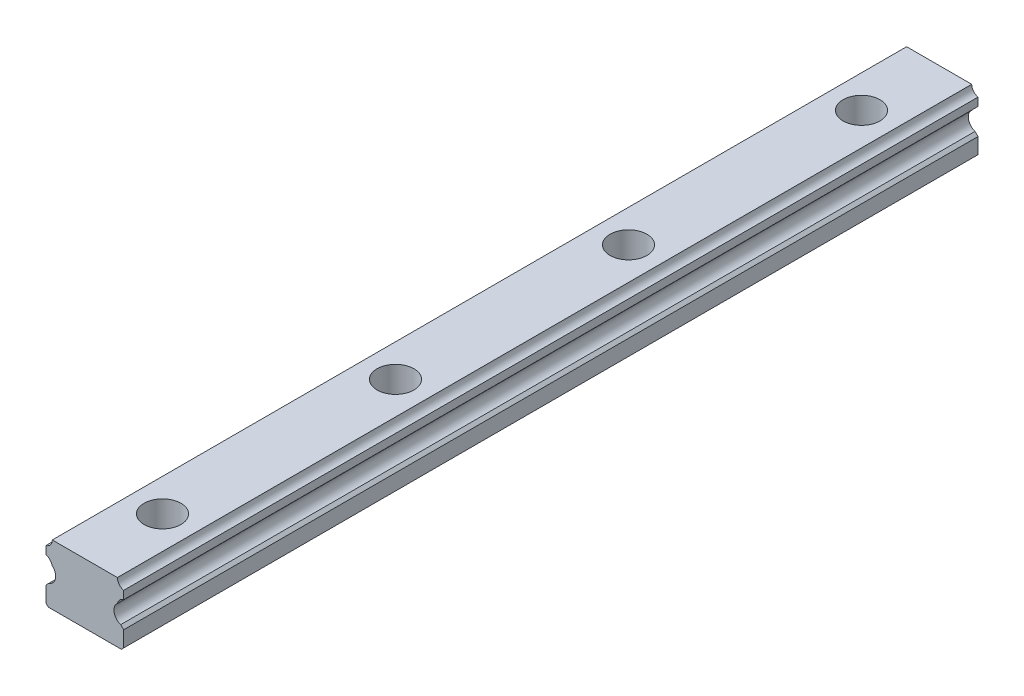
from build123d import *

# Parameters (mm, degrees)
EXTRUDE_1_DEPTH      = 110
EXTRUDE_1_DEPTH_BACK = 110


with BuildPart() as part:
    # Sketch 1 → Extrude 1 (new, two sides: drawn at the far end of the back side and taken through both)
    with BuildSketch(Plane.XY.offset(-EXTRUDE_1_DEPTH_BACK)):
        with BuildLine():
            Line((-10, 0.6), (-9.4, 0))
            Line((-9.4, 0), (9.4, 0))
            Line((9.4, 0), (10, 0.6))
            Line((10, 0.6), (10, 4.652))
            Line((10, 4.652), (9.23068876, 5.42131124))
            ThreePointArc((9.23068876, 5.42131124), (7.542352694, 7.341775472), (8.425172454, 9.741627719))
            ThreePointArc((8.425172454, 9.741627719), (8.976091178, 10.781638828), (10, 11.361936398))
            Line((10, 11.361936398), (10, 13.456063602))
            ThreePointArc((10, 13.456063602), (8.835458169, 14.196581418), (8.382, 15.5))
            Line((8.382, 15.5), (-8.382, 15.5))
            ThreePointArc((-8.382, 15.5), (-8.835458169, 14.196581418), (-10, 13.456063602))
            Line((-10, 13.456063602), (-10, 11.361936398))
            ThreePointArc((-10, 11.361936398), (-8.976091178, 10.781638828), (-8.425172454, 9.741627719))
            ThreePointArc((-8.425172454, 9.741627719), (-7.542352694, 7.341775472), (-9.23068876, 5.42131124))
            Line((-9.23068876, 5.42131124), (-10, 4.652))
            Line((-10, 4.652), (-10, 0.6))
        make_face()
    extrude(amount=EXTRUDE_1_DEPTH + EXTRUDE_1_DEPTH_BACK)

    # Sketch 2 → Cut-Revolve 1 (revolve, cut)
    with BuildSketch(Plane(origin=(0, 0, 0), x_dir=(0, 0, -1), z_dir=(1, 0, 0)), mode=Mode.PRIVATE) as cut_revolve_1_sk:
        Polygon((90, 15.5), (94.75, 15.5), (94.75, 7), (93, 7), (93, 0), (90, 0), align=None)
    revolve(cut_revolve_1_sk.sketch.rotate(Axis((0, 0, -90), (0, 1, 0)), 180), axis=Axis((0, 0, -90), (0, 1, 0)), mode=Mode.SUBTRACT)

    # Sketch 3 → Cut-Revolve 2 (revolve, cut)
    with BuildSketch(Plane(origin=(0, 0, 0), x_dir=(0, 0, -1), z_dir=(1, 0, 0)), mode=Mode.PRIVATE) as cut_revolve_2_sk:
        Polygon((-90, 15.5), (-85.25, 15.5), (-85.25, 7), (-87, 7), (-87, 0), (-90, 0), align=None)
    revolve(cut_revolve_2_sk.sketch.rotate(Axis((0, 0, 90), (0, 1, 0)), 180), axis=Axis((0, 0, 90), (0, 1, 0)), mode=Mode.SUBTRACT)

    # Sketch 4 → Cut-Revolve 3 (revolve, cut)
    with BuildSketch(Plane(origin=(0, 0, 0), x_dir=(0, 0, -1), z_dir=(1, 0, 0)), mode=Mode.PRIVATE) as cut_revolve_3_sk:
        Polygon((-30, 15.5), (-25.25, 15.5), (-25.25, 7), (-27, 7), (-27, 0), (-30, 0), align=None)
    revolve(cut_revolve_3_sk.sketch.rotate(Axis((0, 0, 30), (0, 1, 0)), 180), axis=Axis((0, 0, 30), (0, 1, 0)), mode=Mode.SUBTRACT)

    # Sketch 5 → Cut-Revolve 4 (revolve, cut)
    with BuildSketch(Plane(origin=(0, 0, 0), x_dir=(0, 0, -1), z_dir=(1, 0, 0)), mode=Mode.PRIVATE) as cut_revolve_4_sk:
        Polygon((30, 15.5), (34.75, 15.5), (34.75, 7), (33, 7), (33, 0), (30, 0), align=None)
    revolve(cut_revolve_4_sk.sketch.rotate(Axis((0, 0, -30), (0, 1, 0)), 180), axis=Axis((0, 0, -30), (0, 1, 0)), mode=Mode.SUBTRACT)


solid = part.part
